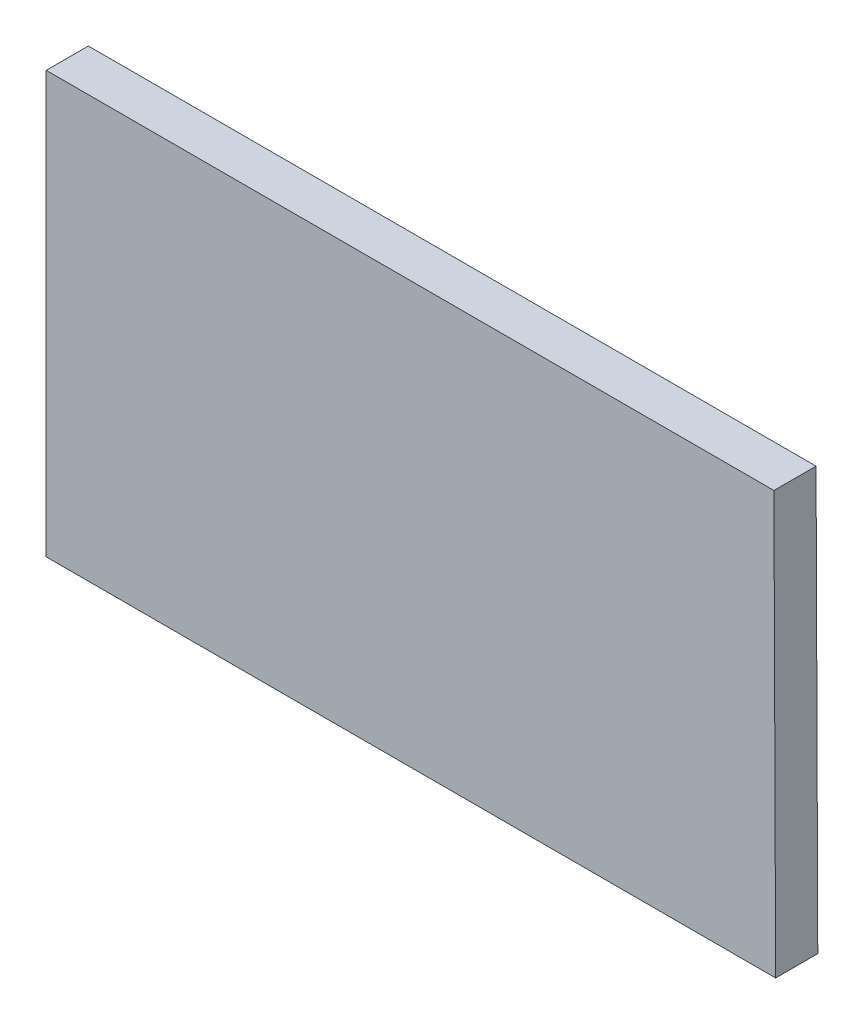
from build123d import *

# Parameters (mm, degrees)
BOSS_EXTRUDE1_DEPTH = 2


with BuildPart() as part:
    # Sketch1 → Boss-Extrude1 (new body)
    with BuildSketch(Plane.XY):
        Polygon((-17.311599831, -10), (17.311599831, -10), (17.230251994, 10), (-17.311599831, 10), align=None)
    extrude(amount=BOSS_EXTRUDE1_DEPTH)


solid = part.part
